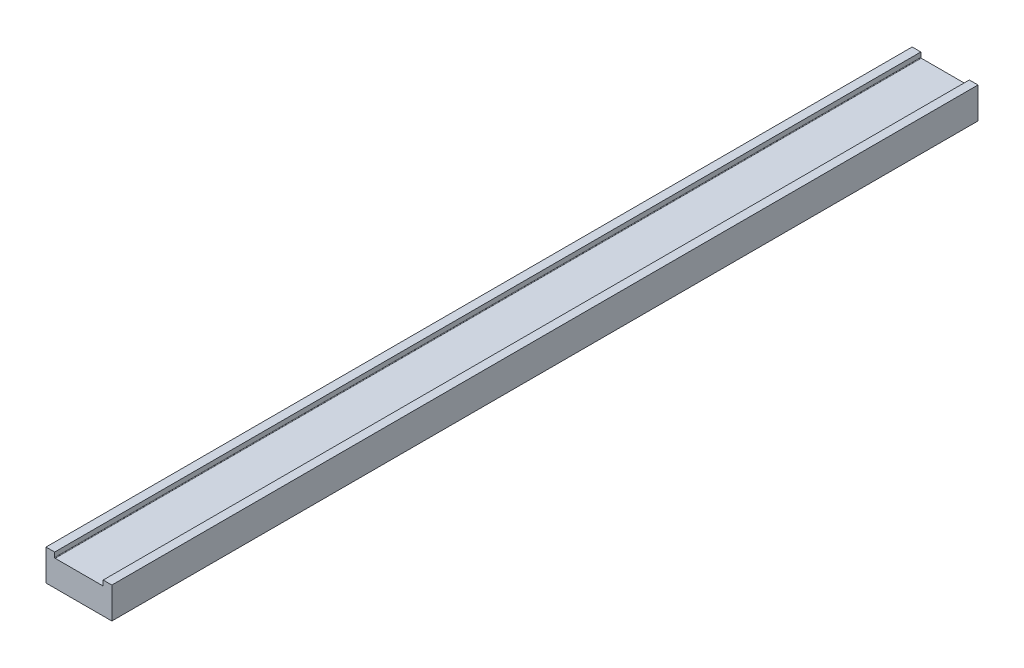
ISO-10303-21;
HEADER;
FILE_DESCRIPTION(('STEP AP214'),'2;1');
FILE_NAME('part.step','',(''),(''),'','','');
FILE_SCHEMA(('AUTOMOTIVE_DESIGN { 1 0 10303 214 1 1 1 1 }'));
ENDSEC;
DATA;
#1=APPLICATION_CONTEXT('core data for automotive mechanical design processes');
#2=APPLICATION_PROTOCOL_DEFINITION('international standard','automotive_design',2000,#1);
#3=PRODUCT_CONTEXT('',#1,'mechanical');
#4=PRODUCT('Part','Part','',(#3));
#5=PRODUCT_RELATED_PRODUCT_CATEGORY('part','',(#4));
#6=PRODUCT_DEFINITION_FORMATION('','',#4);
#7=PRODUCT_DEFINITION_CONTEXT('part definition',#1,'design');
#8=PRODUCT_DEFINITION('design','',#6,#7);
#9=PRODUCT_DEFINITION_SHAPE('','',#8);
#10=(LENGTH_UNIT() NAMED_UNIT(*) SI_UNIT(.MILLI.,.METRE.));
#11=(NAMED_UNIT(*) PLANE_ANGLE_UNIT() SI_UNIT($,.RADIAN.));
#12=(NAMED_UNIT(*) SI_UNIT($,.STERADIAN.) SOLID_ANGLE_UNIT());
#13=UNCERTAINTY_MEASURE_WITH_UNIT(LENGTH_MEASURE(1.E-05),#10,'distance_accuracy_value','');
#14=(GEOMETRIC_REPRESENTATION_CONTEXT(3) GLOBAL_UNCERTAINTY_ASSIGNED_CONTEXT((#13)) GLOBAL_UNIT_ASSIGNED_CONTEXT((#10,
#11,#12)) REPRESENTATION_CONTEXT('',''));
#15=CARTESIAN_POINT('',(0.,0.,0.));
#16=DIRECTION('',(0.,0.,1.));
#17=DIRECTION('',(1.,0.,0.));
#18=AXIS2_PLACEMENT_3D('',#15,#16,#17);
#19=CARTESIAN_POINT('',(14.,18.,0.));
#20=DIRECTION('',(0.,-1.,0.));
#21=DIRECTION('',(0.,0.,-1.));
#22=AXIS2_PLACEMENT_3D('',#19,#20,#21);
#23=PLANE('',#22);
#24=DIRECTION('',(0.,0.,1.));
#25=VECTOR('',#24,1.);
#26=CARTESIAN_POINT('',(19.,18.,0.));
#27=LINE('',#26,#25);
#28=CARTESIAN_POINT('',(19.,18.,0.));
#29=VERTEX_POINT('',#28);
#30=CARTESIAN_POINT('',(19.,18.,500.));
#31=VERTEX_POINT('',#30);
#32=EDGE_CURVE('E9',#29,#31,#27,.T.);
#33=ORIENTED_EDGE('',*,*,#32,.F.);
#34=DIRECTION('',(1.,0.,0.));
#35=VECTOR('',#34,1.);
#36=CARTESIAN_POINT('',(14.,18.,0.));
#37=LINE('',#36,#35);
#38=CARTESIAN_POINT('',(14.,18.,0.));
#39=VERTEX_POINT('',#38);
#40=EDGE_CURVE('E130',#39,#29,#37,.T.);
#41=ORIENTED_EDGE('',*,*,#40,.F.);
#42=DIRECTION('',(0.,0.,1.));
#43=VECTOR('',#42,1.);
#44=CARTESIAN_POINT('',(14.,18.,0.));
#45=LINE('',#44,#43);
#46=CARTESIAN_POINT('',(14.,18.,500.));
#47=VERTEX_POINT('',#46);
#48=EDGE_CURVE('E29',#39,#47,#45,.T.);
#49=ORIENTED_EDGE('',*,*,#48,.T.);
#50=DIRECTION('',(1.,0.,0.));
#51=VECTOR('',#50,1.);
#52=CARTESIAN_POINT('',(14.,18.,500.));
#53=LINE('',#52,#51);
#54=EDGE_CURVE('E101',#47,#31,#53,.T.);
#55=ORIENTED_EDGE('',*,*,#54,.T.);
#56=EDGE_LOOP('',(#33,#41,#49,#55));
#57=FACE_BOUND('',#56,.T.);
#58=ADVANCED_FACE('F14',(#57),#23,.F.);
#59=CARTESIAN_POINT('',(19.,18.,0.));
#60=DIRECTION('',(-1.,0.,0.));
#61=DIRECTION('',(0.,0.,1.));
#62=AXIS2_PLACEMENT_3D('',#59,#60,#61);
#63=PLANE('',#62);
#64=DIRECTION('',(0.,0.,1.));
#65=VECTOR('',#64,1.);
#66=CARTESIAN_POINT('',(19.,0.,0.));
#67=LINE('',#66,#65);
#68=CARTESIAN_POINT('',(19.,0.,0.));
#69=VERTEX_POINT('',#68);
#70=CARTESIAN_POINT('',(19.,0.,500.));
#71=VERTEX_POINT('',#70);
#72=EDGE_CURVE('E22',#69,#71,#67,.T.);
#73=ORIENTED_EDGE('',*,*,#72,.F.);
#74=DIRECTION('',(0.,-1.,0.));
#75=VECTOR('',#74,1.);
#76=CARTESIAN_POINT('',(19.,18.,0.));
#77=LINE('',#76,#75);
#78=EDGE_CURVE('E97',#29,#69,#77,.T.);
#79=ORIENTED_EDGE('',*,*,#78,.F.);
#80=ORIENTED_EDGE('',*,*,#32,.T.);
#81=DIRECTION('',(0.,-1.,0.));
#82=VECTOR('',#81,1.);
#83=CARTESIAN_POINT('',(19.,18.,500.));
#84=LINE('',#83,#82);
#85=EDGE_CURVE('E94',#31,#71,#84,.T.);
#86=ORIENTED_EDGE('',*,*,#85,.T.);
#87=EDGE_LOOP('',(#73,#79,#80,#86));
#88=FACE_BOUND('',#87,.T.);
#89=ADVANCED_FACE('F16',(#88),#63,.F.);
#90=CARTESIAN_POINT('',(-19.,0.,0.));
#91=DIRECTION('',(0.,-1.,0.));
#92=DIRECTION('',(0.,0.,-1.));
#93=AXIS2_PLACEMENT_3D('',#90,#91,#92);
#94=PLANE('',#93);
#95=DIRECTION('',(0.,0.,1.));
#96=VECTOR('',#95,1.);
#97=CARTESIAN_POINT('',(-19.,0.,0.));
#98=LINE('',#97,#96);
#99=CARTESIAN_POINT('',(-19.,0.,0.));
#100=VERTEX_POINT('',#99);
#101=CARTESIAN_POINT('',(-19.,0.,500.));
#102=VERTEX_POINT('',#101);
#103=EDGE_CURVE('E167',#100,#102,#98,.T.);
#104=ORIENTED_EDGE('',*,*,#103,.F.);
#105=DIRECTION('',(1.,0.,0.));
#106=VECTOR('',#105,1.);
#107=CARTESIAN_POINT('',(-19.,0.,0.));
#108=LINE('',#107,#106);
#109=EDGE_CURVE('E133',#100,#69,#108,.T.);
#110=ORIENTED_EDGE('',*,*,#109,.T.);
#111=ORIENTED_EDGE('',*,*,#72,.T.);
#112=DIRECTION('',(1.,0.,0.));
#113=VECTOR('',#112,1.);
#114=CARTESIAN_POINT('',(-19.,0.,500.));
#115=LINE('',#114,#113);
#116=EDGE_CURVE('E108',#102,#71,#115,.T.);
#117=ORIENTED_EDGE('',*,*,#116,.F.);
#118=EDGE_LOOP('',(#104,#110,#111,#117));
#119=FACE_BOUND('',#118,.T.);
#120=ADVANCED_FACE('F169',(#119),#94,.T.);
#121=CARTESIAN_POINT('',(-19.,18.,0.));
#122=DIRECTION('',(-1.,0.,0.));
#123=DIRECTION('',(0.,0.,1.));
#124=AXIS2_PLACEMENT_3D('',#121,#122,#123);
#125=PLANE('',#124);
#126=DIRECTION('',(0.,0.,1.));
#127=VECTOR('',#126,1.);
#128=CARTESIAN_POINT('',(-19.,18.,0.));
#129=LINE('',#128,#127);
#130=CARTESIAN_POINT('',(-19.,18.,0.));
#131=VERTEX_POINT('',#130);
#132=CARTESIAN_POINT('',(-19.,18.,500.));
#133=VERTEX_POINT('',#132);
#134=EDGE_CURVE('E165',#131,#133,#129,.T.);
#135=ORIENTED_EDGE('',*,*,#134,.F.);
#136=DIRECTION('',(0.,-1.,0.));
#137=VECTOR('',#136,1.);
#138=CARTESIAN_POINT('',(-19.,18.,0.));
#139=LINE('',#138,#137);
#140=EDGE_CURVE('E136',#131,#100,#139,.T.);
#141=ORIENTED_EDGE('',*,*,#140,.T.);
#142=ORIENTED_EDGE('',*,*,#103,.T.);
#143=DIRECTION('',(0.,-1.,0.));
#144=VECTOR('',#143,1.);
#145=CARTESIAN_POINT('',(-19.,18.,500.));
#146=LINE('',#145,#144);
#147=EDGE_CURVE('E110',#133,#102,#146,.T.);
#148=ORIENTED_EDGE('',*,*,#147,.F.);
#149=EDGE_LOOP('',(#135,#141,#142,#148));
#150=FACE_BOUND('',#149,.T.);
#151=ADVANCED_FACE('F196',(#150),#125,.T.);
#152=CARTESIAN_POINT('',(-19.,18.,0.));
#153=DIRECTION('',(0.,-1.,0.));
#154=DIRECTION('',(0.,0.,-1.));
#155=AXIS2_PLACEMENT_3D('',#152,#153,#154);
#156=PLANE('',#155);
#157=DIRECTION('',(0.,0.,1.));
#158=VECTOR('',#157,1.);
#159=CARTESIAN_POINT('',(-14.,18.,0.));
#160=LINE('',#159,#158);
#161=CARTESIAN_POINT('',(-14.,18.,0.));
#162=VERTEX_POINT('',#161);
#163=CARTESIAN_POINT('',(-14.,18.,500.));
#164=VERTEX_POINT('',#163);
#165=EDGE_CURVE('E163',#162,#164,#160,.T.);
#166=ORIENTED_EDGE('',*,*,#165,.F.);
#167=DIRECTION('',(1.,0.,0.));
#168=VECTOR('',#167,1.);
#169=CARTESIAN_POINT('',(-19.,18.,0.));
#170=LINE('',#169,#168);
#171=EDGE_CURVE('E139',#131,#162,#170,.T.);
#172=ORIENTED_EDGE('',*,*,#171,.F.);
#173=ORIENTED_EDGE('',*,*,#134,.T.);
#174=DIRECTION('',(1.,0.,0.));
#175=VECTOR('',#174,1.);
#176=CARTESIAN_POINT('',(-19.,18.,500.));
#177=LINE('',#176,#175);
#178=EDGE_CURVE('E114',#133,#164,#177,.T.);
#179=ORIENTED_EDGE('',*,*,#178,.T.);
#180=EDGE_LOOP('',(#166,#172,#173,#179));
#181=FACE_BOUND('',#180,.T.);
#182=ADVANCED_FACE('F193',(#181),#156,.F.);
#183=CARTESIAN_POINT('',(-14.,18.,0.));
#184=DIRECTION('',(-1.,0.,0.));
#185=DIRECTION('',(0.,-1.,0.));
#186=AXIS2_PLACEMENT_3D('',#183,#184,#185);
#187=PLANE('',#186);
#188=DIRECTION('',(0.,0.,1.));
#189=VECTOR('',#188,1.);
#190=CARTESIAN_POINT('',(-14.,15.3,0.));
#191=LINE('',#190,#189);
#192=CARTESIAN_POINT('',(-14.,15.3,0.));
#193=VERTEX_POINT('',#192);
#194=CARTESIAN_POINT('',(-14.,15.3,500.));
#195=VERTEX_POINT('',#194);
#196=EDGE_CURVE('E161',#193,#195,#191,.T.);
#197=ORIENTED_EDGE('',*,*,#196,.F.);
#198=DIRECTION('',(0.,-1.,0.));
#199=VECTOR('',#198,1.);
#200=CARTESIAN_POINT('',(-14.,18.,0.));
#201=LINE('',#200,#199);
#202=EDGE_CURVE('E142',#162,#193,#201,.T.);
#203=ORIENTED_EDGE('',*,*,#202,.F.);
#204=ORIENTED_EDGE('',*,*,#165,.T.);
#205=DIRECTION('',(0.,-1.,0.));
#206=VECTOR('',#205,1.);
#207=CARTESIAN_POINT('',(-14.,18.,500.));
#208=LINE('',#207,#206);
#209=EDGE_CURVE('E117',#164,#195,#208,.T.);
#210=ORIENTED_EDGE('',*,*,#209,.T.);
#211=EDGE_LOOP('',(#197,#203,#204,#210));
#212=FACE_BOUND('',#211,.T.);
#213=ADVANCED_FACE('F189',(#212),#187,.F.);
#214=CARTESIAN_POINT('',(-13.7,15.3,0.));
#215=DIRECTION('',(0.,0.,1.));
#216=DIRECTION('',(1.,0.,0.));
#217=AXIS2_PLACEMENT_3D('',#214,#215,#216);
#218=CYLINDRICAL_SURFACE('',#217,0.3);
#219=DIRECTION('',(0.,0.,1.));
#220=VECTOR('',#219,1.);
#221=CARTESIAN_POINT('',(-13.7,15.,0.));
#222=LINE('',#221,#220);
#223=CARTESIAN_POINT('',(-13.7,15.,0.));
#224=VERTEX_POINT('',#223);
#225=CARTESIAN_POINT('',(-13.7,15.,500.));
#226=VERTEX_POINT('',#225);
#227=EDGE_CURVE('E159',#224,#226,#222,.T.);
#228=ORIENTED_EDGE('',*,*,#227,.F.);
#229=CARTESIAN_POINT('',(-13.7,15.3,0.));
#230=DIRECTION('',(0.,0.,1.));
#231=DIRECTION('',(1.,0.,0.));
#232=AXIS2_PLACEMENT_3D('',#229,#230,#231);
#233=CIRCLE('',#232,0.3);
#234=EDGE_CURVE('E145',#193,#224,#233,.T.);
#235=ORIENTED_EDGE('',*,*,#234,.F.);
#236=ORIENTED_EDGE('',*,*,#196,.T.);
#237=CARTESIAN_POINT('',(-13.7,15.3,500.));
#238=DIRECTION('',(0.,0.,1.));
#239=DIRECTION('',(1.,0.,0.));
#240=AXIS2_PLACEMENT_3D('',#237,#238,#239);
#241=CIRCLE('',#240,0.3);
#242=EDGE_CURVE('E120',#195,#226,#241,.T.);
#243=ORIENTED_EDGE('',*,*,#242,.T.);
#244=EDGE_LOOP('',(#228,#235,#236,#243));
#245=FACE_BOUND('',#244,.T.);
#246=ADVANCED_FACE('F186',(#245),#218,.F.);
#247=CARTESIAN_POINT('',(-13.7,15.,0.));
#248=DIRECTION('',(0.,-1.,0.));
#249=DIRECTION('',(1.,0.,0.));
#250=AXIS2_PLACEMENT_3D('',#247,#248,#249);
#251=PLANE('',#250);
#252=DIRECTION('',(0.,0.,1.));
#253=VECTOR('',#252,1.);
#254=CARTESIAN_POINT('',(13.7,15.,0.));
#255=LINE('',#254,#253);
#256=CARTESIAN_POINT('',(13.7,15.,0.));
#257=VERTEX_POINT('',#256);
#258=CARTESIAN_POINT('',(13.7,15.,500.));
#259=VERTEX_POINT('',#258);
#260=EDGE_CURVE('E157',#257,#259,#255,.T.);
#261=ORIENTED_EDGE('',*,*,#260,.F.);
#262=DIRECTION('',(1.,0.,0.));
#263=VECTOR('',#262,1.);
#264=CARTESIAN_POINT('',(-13.7,15.,0.));
#265=LINE('',#264,#263);
#266=EDGE_CURVE('E148',#224,#257,#265,.T.);
#267=ORIENTED_EDGE('',*,*,#266,.F.);
#268=ORIENTED_EDGE('',*,*,#227,.T.);
#269=DIRECTION('',(1.,0.,0.));
#270=VECTOR('',#269,1.);
#271=CARTESIAN_POINT('',(-13.7,15.,500.));
#272=LINE('',#271,#270);
#273=EDGE_CURVE('E123',#226,#259,#272,.T.);
#274=ORIENTED_EDGE('',*,*,#273,.T.);
#275=EDGE_LOOP('',(#261,#267,#268,#274));
#276=FACE_BOUND('',#275,.T.);
#277=ADVANCED_FACE('F182',(#276),#251,.F.);
#278=CARTESIAN_POINT('',(13.7,15.3,0.));
#279=DIRECTION('',(0.,0.,1.));
#280=DIRECTION('',(1.,0.,0.));
#281=AXIS2_PLACEMENT_3D('',#278,#279,#280);
#282=CYLINDRICAL_SURFACE('',#281,0.299999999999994);
#283=DIRECTION('',(0.,0.,1.));
#284=VECTOR('',#283,1.);
#285=CARTESIAN_POINT('',(14.,15.3,0.));
#286=LINE('',#285,#284);
#287=CARTESIAN_POINT('',(14.,15.3,0.));
#288=VERTEX_POINT('',#287);
#289=CARTESIAN_POINT('',(14.,15.3,500.));
#290=VERTEX_POINT('',#289);
#291=EDGE_CURVE('E37',#288,#290,#286,.T.);
#292=ORIENTED_EDGE('',*,*,#291,.F.);
#293=CARTESIAN_POINT('',(13.7,15.3,0.));
#294=DIRECTION('',(0.,0.,1.));
#295=DIRECTION('',(1.,0.,0.));
#296=AXIS2_PLACEMENT_3D('',#293,#294,#295);
#297=CIRCLE('',#296,0.299999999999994);
#298=EDGE_CURVE('E151',#257,#288,#297,.T.);
#299=ORIENTED_EDGE('',*,*,#298,.F.);
#300=ORIENTED_EDGE('',*,*,#260,.T.);
#301=CARTESIAN_POINT('',(13.7,15.3,500.));
#302=DIRECTION('',(0.,0.,1.));
#303=DIRECTION('',(1.,0.,0.));
#304=AXIS2_PLACEMENT_3D('',#301,#302,#303);
#305=CIRCLE('',#304,0.299999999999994);
#306=EDGE_CURVE('E126',#259,#290,#305,.T.);
#307=ORIENTED_EDGE('',*,*,#306,.T.);
#308=EDGE_LOOP('',(#292,#299,#300,#307));
#309=FACE_BOUND('',#308,.T.);
#310=ADVANCED_FACE('F177',(#309),#282,.F.);
#311=CARTESIAN_POINT('',(14.,18.,0.));
#312=DIRECTION('',(-1.,0.,0.));
#313=DIRECTION('',(0.,0.,1.));
#314=AXIS2_PLACEMENT_3D('',#311,#312,#313);
#315=PLANE('',#314);
#316=DIRECTION('',(0.,-1.,0.));
#317=VECTOR('',#316,1.);
#318=CARTESIAN_POINT('',(14.,18.,0.));
#319=LINE('',#318,#317);
#320=EDGE_CURVE('E153',#39,#288,#319,.T.);
#321=ORIENTED_EDGE('',*,*,#320,.T.);
#322=ORIENTED_EDGE('',*,*,#291,.T.);
#323=DIRECTION('',(0.,-1.,0.));
#324=VECTOR('',#323,1.);
#325=CARTESIAN_POINT('',(14.,18.,500.));
#326=LINE('',#325,#324);
#327=EDGE_CURVE('E128',#47,#290,#326,.T.);
#328=ORIENTED_EDGE('',*,*,#327,.F.);
#329=ORIENTED_EDGE('',*,*,#48,.F.);
#330=EDGE_LOOP('',(#321,#322,#328,#329));
#331=FACE_BOUND('',#330,.T.);
#332=ADVANCED_FACE('F175',(#331),#315,.T.);
#333=CARTESIAN_POINT('',(-13.7,15.3,0.));
#334=DIRECTION('',(0.,0.,1.));
#335=DIRECTION('',(1.,0.,0.));
#336=AXIS2_PLACEMENT_3D('',#333,#334,#335);
#337=PLANE('',#336);
#338=ORIENTED_EDGE('',*,*,#40,.T.);
#339=ORIENTED_EDGE('',*,*,#78,.T.);
#340=ORIENTED_EDGE('',*,*,#109,.F.);
#341=ORIENTED_EDGE('',*,*,#140,.F.);
#342=ORIENTED_EDGE('',*,*,#171,.T.);
#343=ORIENTED_EDGE('',*,*,#202,.T.);
#344=ORIENTED_EDGE('',*,*,#234,.T.);
#345=ORIENTED_EDGE('',*,*,#266,.T.);
#346=ORIENTED_EDGE('',*,*,#298,.T.);
#347=ORIENTED_EDGE('',*,*,#320,.F.);
#348=EDGE_LOOP('',(#338,#339,#340,#341,#342,#343,#344,#345,#346,#347));
#349=FACE_BOUND('',#348,.T.);
#350=ADVANCED_FACE('F172',(#349),#337,.F.);
#351=CARTESIAN_POINT('',(-13.7,15.3,500.));
#352=DIRECTION('',(0.,0.,1.));
#353=DIRECTION('',(1.,0.,0.));
#354=AXIS2_PLACEMENT_3D('',#351,#352,#353);
#355=PLANE('',#354);
#356=ORIENTED_EDGE('',*,*,#54,.F.);
#357=ORIENTED_EDGE('',*,*,#327,.T.);
#358=ORIENTED_EDGE('',*,*,#306,.F.);
#359=ORIENTED_EDGE('',*,*,#273,.F.);
#360=ORIENTED_EDGE('',*,*,#242,.F.);
#361=ORIENTED_EDGE('',*,*,#209,.F.);
#362=ORIENTED_EDGE('',*,*,#178,.F.);
#363=ORIENTED_EDGE('',*,*,#147,.T.);
#364=ORIENTED_EDGE('',*,*,#116,.T.);
#365=ORIENTED_EDGE('',*,*,#85,.F.);
#366=EDGE_LOOP('',(#356,#357,#358,#359,#360,#361,#362,#363,#364,#365));
#367=FACE_BOUND('',#366,.T.);
#368=ADVANCED_FACE('F105',(#367),#355,.T.);
#369=CLOSED_SHELL('',(#58,#89,#120,#151,#182,#213,#246,#277,#310,#332,#350,#368));
#370=MANIFOLD_SOLID_BREP('B1',#369);
#371=ADVANCED_BREP_SHAPE_REPRESENTATION('',(#18,#370),#14);
#372=SHAPE_DEFINITION_REPRESENTATION(#9,#371);
ENDSEC;
END-ISO-10303-21;
